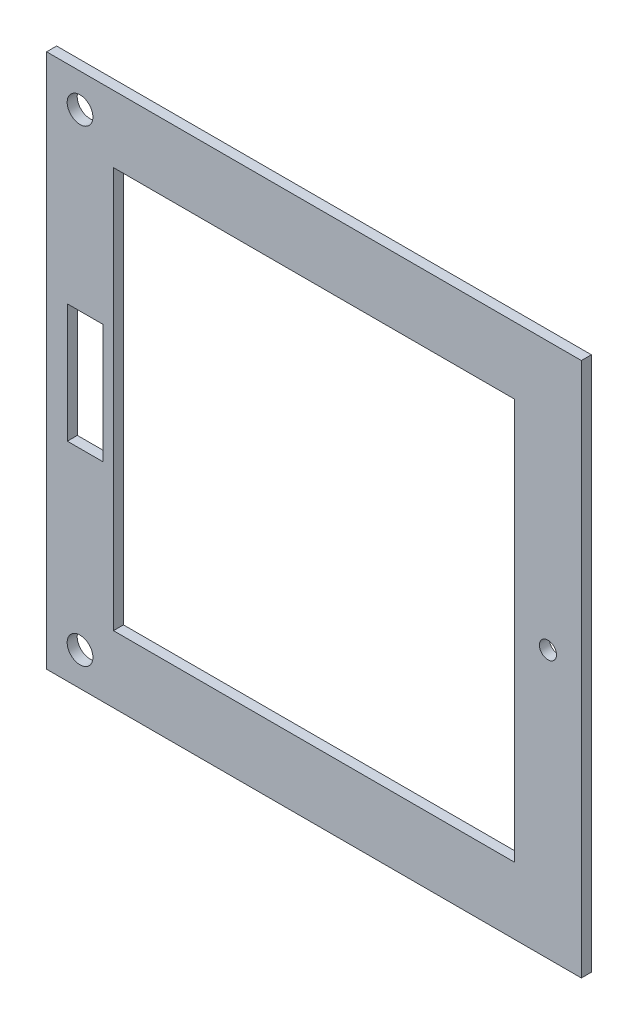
from build123d import *

# Parameters (mm, degrees)
ESQUISSE1_W             = 320
ESQUISSE1_H             = 320
ESQUISSE1_W_2           = 240
ESQUISSE1_H_2           = 240
BOSS_EXTRU_2_DEPTH      = 6
ESQUISSE2_R             = 7.7
ESQUISSE2_R_2           = 5.1
ESQUISSE2_W             = 21.2
ESQUISSE2_H             = 71.2
ENL_V_MAT_EXTRU_1_DEPTH = 6


with BuildPart() as part:
    # Esquisse1 → Boss.-Extru.2 (new body)
    with BuildSketch(Plane.XY):
        with Locations((120, 120)):
            Rectangle(ESQUISSE1_W, ESQUISSE1_H)
        with Locations((120, 120)):
            Rectangle(ESQUISSE1_W_2, ESQUISSE1_H_2, mode=Mode.SUBTRACT)
    extrude(amount=BOSS_EXTRU_2_DEPTH)

    # Esquisse2 → Enl_v. mat.-Extru.1 (cut)
    with BuildSketch(Plane.XY.offset(6)):
        with Locations((-20, 260)):
            Circle(ESQUISSE2_R)
        with Locations((260, 120)):
            Circle(ESQUISSE2_R_2)
        with Locations((-20, -20)):
            Circle(ESQUISSE2_R)
        with Locations((-17, 120)):
            Rectangle(ESQUISSE2_W, ESQUISSE2_H)
    extrude(amount=-ENL_V_MAT_EXTRU_1_DEPTH, mode=Mode.SUBTRACT)


solid = part.part
